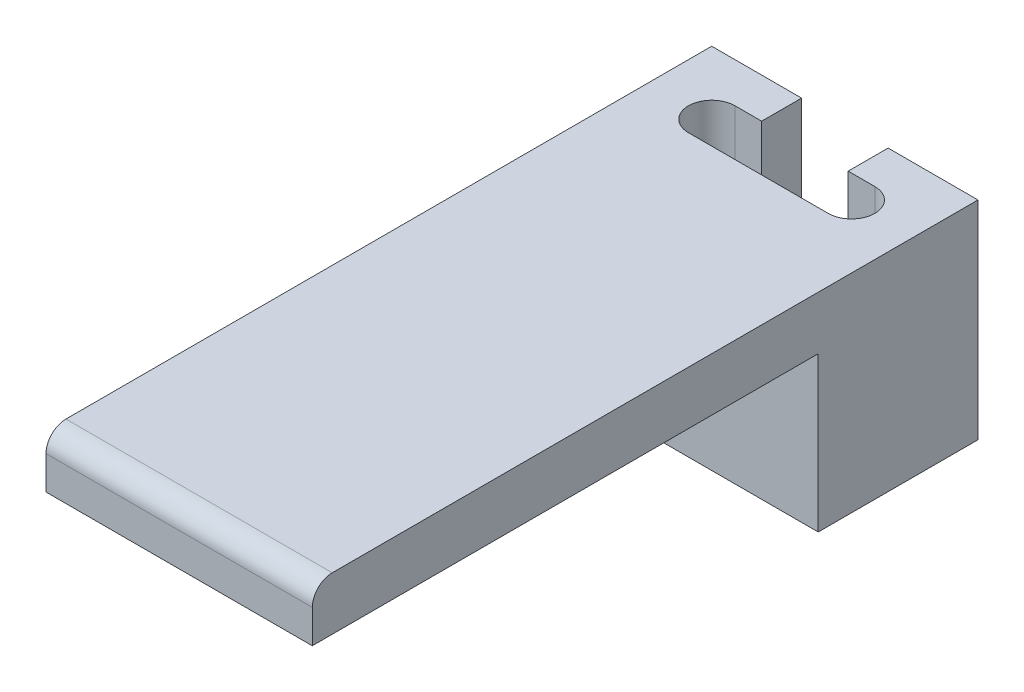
from build123d import *

# Parameters (mm, degrees)
SKETCH_1_W          = 20
SKETCH_1_H          = 15.6
EXTRUDE_1_DEPTH     = 50
SKETCH_2_OUTSIDE_W  = 63.214
SKETCH_2_OUTSIDE_H  = 28.814
CUT_EXTRUDE_1_DEPTH = 50
SKETCH_3_OUTSIDE_W  = 33.214
SKETCH_3_OUTSIDE_H  = 63.214
CUT_EXTRUDE_2_DEPTH = 50


with BuildPart() as part:
    # Sketch 1 → Extrude 1 (new body)
    with BuildSketch(Plane.XY):
        with Locations((10, 7.8)):
            Rectangle(SKETCH_1_W, SKETCH_1_H)
    extrude(amount=EXTRUDE_1_DEPTH)

    # Sketch 2 outside → Cut-Extrude 1 (cut)
    with BuildSketch(Plane(origin=(20, 0, 0), x_dir=(0, 0, -1), z_dir=(1, 0, 0))):
        with Locations((-25, 7.8)):
            Rectangle(SKETCH_2_OUTSIDE_W, SKETCH_2_OUTSIDE_H)
        with BuildLine():
            Line((-48.5, 15.6), (0, 15.6))
            Line((0, 15.6), (0, 0))
            Line((0, 0), (-12, 0))
            Line((-12, 0), (-12, 11.6))
            Line((-12, 11.6), (-50, 11.6))
            Line((-50, 11.6), (-50, 14.1))
            ThreePointArc((-50, 14.1), (-49.560660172, 15.160660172), (-48.5, 15.6))
        make_face(mode=Mode.SUBTRACT)
    extrude(amount=-CUT_EXTRUDE_1_DEPTH, mode=Mode.SUBTRACT)

    # Sketch 3 outside → Cut-Extrude 2 (cut)
    with BuildSketch(Plane(origin=(0, 15.6, 0), x_dir=(1, 0, 0), z_dir=(0, 1, 0))):
        with Locations((10, -25)):
            Rectangle(SKETCH_3_OUTSIDE_W, SKETCH_3_OUTSIDE_H)
        with BuildLine():
            Line((0, -50), (20, -50))
            Line((20, -50), (20, 0))
            Line((20, 0), (13.25, 0))
            Line((13.25, 0), (13.25, -3))
            Line((13.25, -3), (15.25, -3))
            ThreePointArc((15.25, -3), (17, -4.75), (15.25, -6.5))
            Line((15.25, -6.5), (4.75, -6.5))
            ThreePointArc((4.75, -6.5), (3, -4.75), (4.75, -3))
            Line((4.75, -3), (6.75, -3))
            Line((6.75, -3), (6.75, 0))
            Line((6.75, 0), (0, 0))
            Line((0, 0), (0, -50))
        make_face(mode=Mode.SUBTRACT)
    extrude(amount=-CUT_EXTRUDE_2_DEPTH, mode=Mode.SUBTRACT)


solid = part.part
